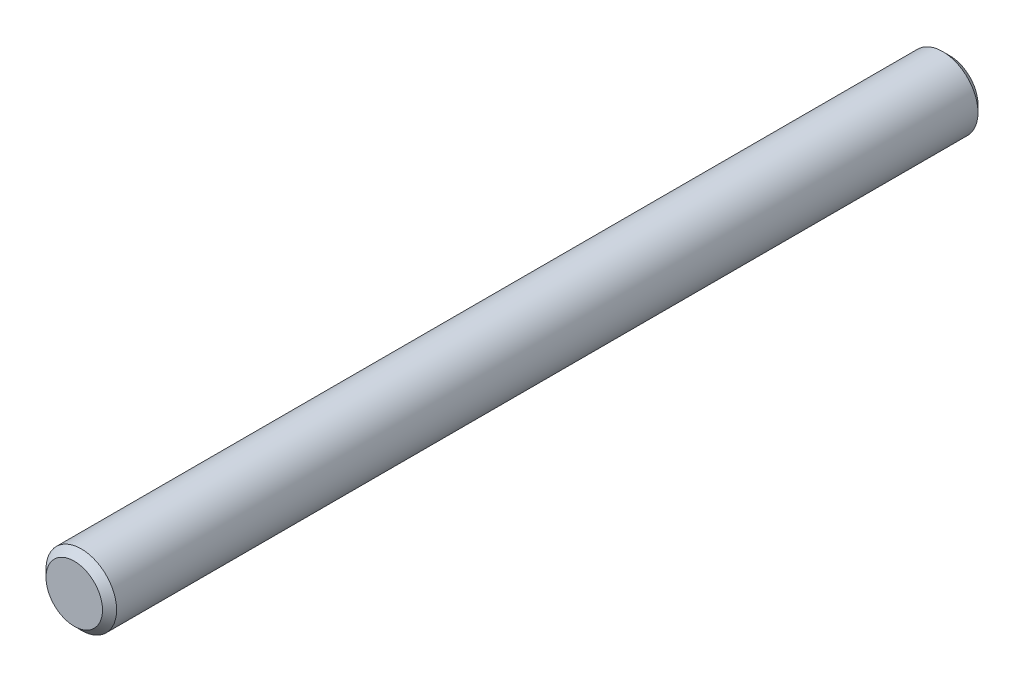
ISO-10303-21;
HEADER;
FILE_DESCRIPTION(('STEP AP214'),'2;1');
FILE_NAME('part.step','',(''),(''),'','','');
FILE_SCHEMA(('AUTOMOTIVE_DESIGN { 1 0 10303 214 1 1 1 1 }'));
ENDSEC;
DATA;
#1=APPLICATION_CONTEXT('core data for automotive mechanical design processes');
#2=APPLICATION_PROTOCOL_DEFINITION('international standard','automotive_design',2000,#1);
#3=PRODUCT_CONTEXT('',#1,'mechanical');
#4=PRODUCT('Part','Part','',(#3));
#5=PRODUCT_RELATED_PRODUCT_CATEGORY('part','',(#4));
#6=PRODUCT_DEFINITION_FORMATION('','',#4);
#7=PRODUCT_DEFINITION_CONTEXT('part definition',#1,'design');
#8=PRODUCT_DEFINITION('design','',#6,#7);
#9=PRODUCT_DEFINITION_SHAPE('','',#8);
#10=(LENGTH_UNIT() NAMED_UNIT(*) SI_UNIT(.MILLI.,.METRE.));
#11=(NAMED_UNIT(*) PLANE_ANGLE_UNIT() SI_UNIT($,.RADIAN.));
#12=(NAMED_UNIT(*) SI_UNIT($,.STERADIAN.) SOLID_ANGLE_UNIT());
#13=UNCERTAINTY_MEASURE_WITH_UNIT(LENGTH_MEASURE(1.E-05),#10,'distance_accuracy_value','');
#14=(GEOMETRIC_REPRESENTATION_CONTEXT(3) GLOBAL_UNCERTAINTY_ASSIGNED_CONTEXT((#13)) GLOBAL_UNIT_ASSIGNED_CONTEXT((#10,
#11,#12)) REPRESENTATION_CONTEXT('',''));
#15=CARTESIAN_POINT('',(0.,0.,0.));
#16=DIRECTION('',(0.,0.,1.));
#17=DIRECTION('',(1.,0.,0.));
#18=AXIS2_PLACEMENT_3D('',#15,#16,#17);
#19=CARTESIAN_POINT('',(0.,0.,124.));
#20=DIRECTION('',(0.,0.,-1.));
#21=DIRECTION('',(-1.,0.,0.));
#22=AXIS2_PLACEMENT_3D('',#19,#20,#21);
#23=CYLINDRICAL_SURFACE('',#22,5.);
#24=CARTESIAN_POINT('',(0.,0.,123.));
#25=DIRECTION('',(0.,0.,1.));
#26=DIRECTION('',(1.,0.,0.));
#27=AXIS2_PLACEMENT_3D('',#24,#25,#26);
#28=CIRCLE('',#27,5.);
#29=CARTESIAN_POINT('',(5.,0.,123.));
#30=VERTEX_POINT('',#29);
#31=EDGE_CURVE('E37',#30,#30,#28,.F.);
#32=ORIENTED_EDGE('',*,*,#31,.T.);
#33=EDGE_LOOP('',(#32));
#34=FACE_BOUND('',#33,.T.);
#35=CARTESIAN_POINT('',(0.,0.,1.));
#36=DIRECTION('',(0.,0.,1.));
#37=DIRECTION('',(1.,0.,0.));
#38=AXIS2_PLACEMENT_3D('',#35,#36,#37);
#39=CIRCLE('',#38,5.);
#40=CARTESIAN_POINT('',(5.,0.,1.));
#41=VERTEX_POINT('',#40);
#42=EDGE_CURVE('E41',#41,#41,#39,.T.);
#43=ORIENTED_EDGE('',*,*,#42,.T.);
#44=EDGE_LOOP('',(#43));
#45=FACE_BOUND('',#44,.T.);
#46=ADVANCED_FACE('F31',(#34,#45),#23,.T.);
#47=CARTESIAN_POINT('',(0.,0.,124.));
#48=DIRECTION('',(0.,0.,1.));
#49=DIRECTION('',(1.,0.,0.));
#50=AXIS2_PLACEMENT_3D('',#47,#48,#49);
#51=PLANE('',#50);
#52=CARTESIAN_POINT('',(0.,0.,124.));
#53=DIRECTION('',(0.,0.,1.));
#54=DIRECTION('',(1.,0.,0.));
#55=AXIS2_PLACEMENT_3D('',#52,#53,#54);
#56=CIRCLE('',#55,4.);
#57=CARTESIAN_POINT('',(4.,0.,124.));
#58=VERTEX_POINT('',#57);
#59=EDGE_CURVE('E45',#58,#58,#56,.T.);
#60=ORIENTED_EDGE('',*,*,#59,.T.);
#61=EDGE_LOOP('',(#60));
#62=FACE_BOUND('',#61,.T.);
#63=ADVANCED_FACE('F51',(#62),#51,.T.);
#64=CARTESIAN_POINT('',(0.,0.,0.));
#65=DIRECTION('',(0.,0.,1.));
#66=DIRECTION('',(1.,0.,0.));
#67=AXIS2_PLACEMENT_3D('',#64,#65,#66);
#68=PLANE('',#67);
#69=CARTESIAN_POINT('',(0.,0.,0.));
#70=DIRECTION('',(0.,0.,1.));
#71=DIRECTION('',(1.,0.,0.));
#72=AXIS2_PLACEMENT_3D('',#69,#70,#71);
#73=CIRCLE('',#72,3.99999999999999);
#74=CARTESIAN_POINT('',(3.99999999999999,0.,0.));
#75=VERTEX_POINT('',#74);
#76=EDGE_CURVE('E10',#75,#75,#73,.F.);
#77=ORIENTED_EDGE('',*,*,#76,.T.);
#78=EDGE_LOOP('',(#77));
#79=FACE_BOUND('',#78,.T.);
#80=ADVANCED_FACE('F56',(#79),#68,.F.);
#81=CARTESIAN_POINT('',(0.,0.,124.));
#82=DIRECTION('',(0.,0.,-1.));
#83=DIRECTION('',(-1.,0.,0.));
#84=AXIS2_PLACEMENT_3D('',#81,#82,#83);
#85=CONICAL_SURFACE('',#84,4.,0.785398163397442);
#86=ORIENTED_EDGE('',*,*,#31,.F.);
#87=EDGE_LOOP('',(#86));
#88=FACE_BOUND('',#87,.T.);
#89=ORIENTED_EDGE('',*,*,#59,.F.);
#90=EDGE_LOOP('',(#89));
#91=FACE_BOUND('',#90,.T.);
#92=ADVANCED_FACE('F53',(#88,#91),#85,.T.);
#93=CARTESIAN_POINT('',(0.,0.,1.));
#94=DIRECTION('',(0.,0.,1.));
#95=DIRECTION('',(1.,0.,0.));
#96=AXIS2_PLACEMENT_3D('',#93,#94,#95);
#97=CONICAL_SURFACE('',#96,5.,0.785398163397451);
#98=ORIENTED_EDGE('',*,*,#76,.F.);
#99=EDGE_LOOP('',(#98));
#100=FACE_BOUND('',#99,.T.);
#101=ORIENTED_EDGE('',*,*,#42,.F.);
#102=EDGE_LOOP('',(#101));
#103=FACE_BOUND('',#102,.T.);
#104=ADVANCED_FACE('F55',(#100,#103),#97,.T.);
#105=CLOSED_SHELL('',(#46,#63,#80,#92,#104));
#106=MANIFOLD_SOLID_BREP('B2',#105);
#107=ADVANCED_BREP_SHAPE_REPRESENTATION('',(#18,#106),#14);
#108=SHAPE_DEFINITION_REPRESENTATION(#9,#107);
ENDSEC;
END-ISO-10303-21;
